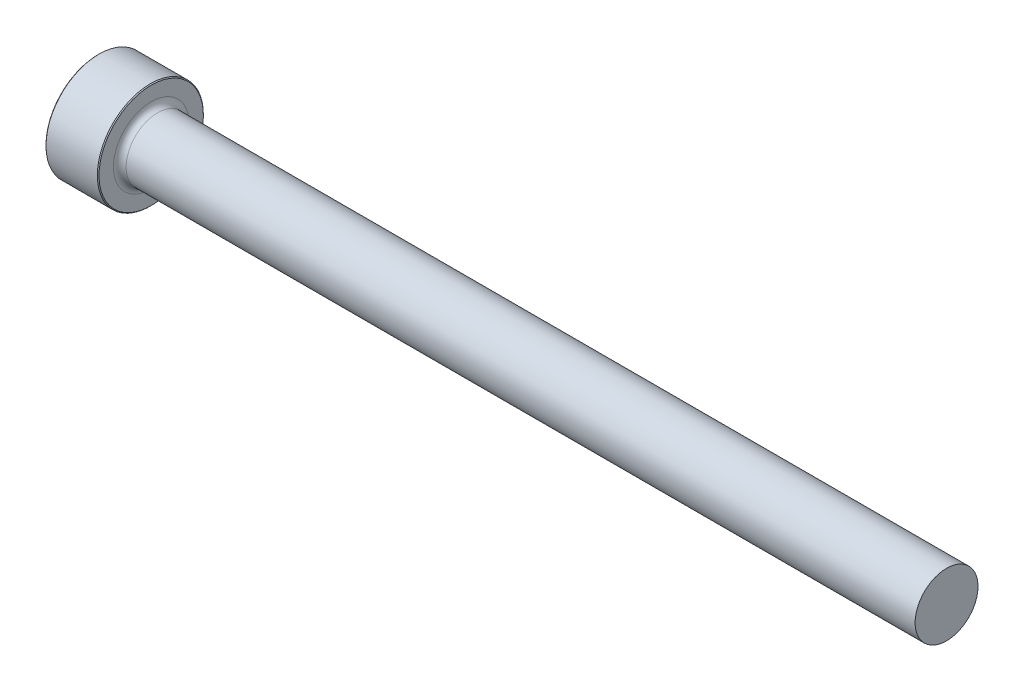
ISO-10303-21;
HEADER;
FILE_DESCRIPTION(('STEP AP214'),'2;1');
FILE_NAME('part.step','',(''),(''),'','','');
FILE_SCHEMA(('AUTOMOTIVE_DESIGN { 1 0 10303 214 1 1 1 1 }'));
ENDSEC;
DATA;
#1=APPLICATION_CONTEXT('core data for automotive mechanical design processes');
#2=APPLICATION_PROTOCOL_DEFINITION('international standard','automotive_design',2000,#1);
#3=PRODUCT_CONTEXT('',#1,'mechanical');
#4=PRODUCT('Part','Part','',(#3));
#5=PRODUCT_RELATED_PRODUCT_CATEGORY('part','',(#4));
#6=PRODUCT_DEFINITION_FORMATION('','',#4);
#7=PRODUCT_DEFINITION_CONTEXT('part definition',#1,'design');
#8=PRODUCT_DEFINITION('design','',#6,#7);
#9=PRODUCT_DEFINITION_SHAPE('','',#8);
#10=(LENGTH_UNIT() NAMED_UNIT(*) SI_UNIT(.MILLI.,.METRE.));
#11=(NAMED_UNIT(*) PLANE_ANGLE_UNIT() SI_UNIT($,.RADIAN.));
#12=(NAMED_UNIT(*) SI_UNIT($,.STERADIAN.) SOLID_ANGLE_UNIT());
#13=UNCERTAINTY_MEASURE_WITH_UNIT(LENGTH_MEASURE(1.E-05),#10,'distance_accuracy_value','');
#14=(GEOMETRIC_REPRESENTATION_CONTEXT(3) GLOBAL_UNCERTAINTY_ASSIGNED_CONTEXT((#13)) GLOBAL_UNIT_ASSIGNED_CONTEXT((#10,
#11,#12)) REPRESENTATION_CONTEXT('',''));
#15=CARTESIAN_POINT('',(0.,0.,0.));
#16=DIRECTION('',(0.,0.,1.));
#17=DIRECTION('',(1.,0.,0.));
#18=AXIS2_PLACEMENT_3D('',#15,#16,#17);
#19=CARTESIAN_POINT('',(101.6,3.76650249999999,0.));
#20=DIRECTION('',(1.,0.,0.));
#21=DIRECTION('',(0.,1.,0.));
#22=AXIS2_PLACEMENT_3D('',#19,#20,#21);
#23=PLANE('',#22);
#24=CARTESIAN_POINT('',(101.6,0.,0.));
#25=DIRECTION('',(1.,0.,0.));
#26=DIRECTION('',(0.,1.,0.));
#27=AXIS2_PLACEMENT_3D('',#24,#25,#26);
#28=CIRCLE('',#27,3.7665025);
#29=CARTESIAN_POINT('',(101.6,3.76650249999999,0.));
#30=VERTEX_POINT('',#29);
#31=EDGE_CURVE('E50',#30,#30,#28,.T.);
#32=ORIENTED_EDGE('',*,*,#31,.T.);
#33=EDGE_LOOP('',(#32));
#34=FACE_BOUND('',#33,.T.);
#35=ADVANCED_FACE('F30',(#34),#23,.T.);
#36=CARTESIAN_POINT('',(101.6,0.,0.));
#37=DIRECTION('',(1.,0.,0.));
#38=DIRECTION('',(0.,1.,0.));
#39=AXIS2_PLACEMENT_3D('',#36,#37,#38);
#40=CYLINDRICAL_SURFACE('',#39,3.7665025);
#41=CARTESIAN_POINT('',(7.11199999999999,0.,0.));
#42=DIRECTION('',(1.,0.,0.));
#43=DIRECTION('',(0.,1.,0.));
#44=AXIS2_PLACEMENT_3D('',#41,#42,#43);
#45=CIRCLE('',#44,3.76650249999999);
#46=CARTESIAN_POINT('',(7.11199999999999,3.76650249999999,0.));
#47=VERTEX_POINT('',#46);
#48=EDGE_CURVE('E53',#47,#47,#45,.T.);
#49=ORIENTED_EDGE('',*,*,#48,.T.);
#50=EDGE_LOOP('',(#49));
#51=FACE_BOUND('',#50,.T.);
#52=ORIENTED_EDGE('',*,*,#31,.F.);
#53=EDGE_LOOP('',(#52));
#54=FACE_BOUND('',#53,.T.);
#55=ADVANCED_FACE('F74',(#51,#54),#40,.T.);
#56=CARTESIAN_POINT('',(7.112,0.,0.));
#57=DIRECTION('',(1.,0.,0.));
#58=DIRECTION('',(0.,1.,0.));
#59=AXIS2_PLACEMENT_3D('',#56,#57,#58);
#60=TOROIDAL_SURFACE('',#59,4.52850249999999,0.762);
#61=CARTESIAN_POINT('',(6.34999999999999,0.,0.));
#62=DIRECTION('',(1.,0.,0.));
#63=DIRECTION('',(0.,1.,0.));
#64=AXIS2_PLACEMENT_3D('',#61,#62,#63);
#65=CIRCLE('',#64,4.52850249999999);
#66=CARTESIAN_POINT('',(6.34999999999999,4.52850249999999,0.));
#67=VERTEX_POINT('',#66);
#68=EDGE_CURVE('E56',#67,#67,#65,.T.);
#69=ORIENTED_EDGE('',*,*,#68,.T.);
#70=EDGE_LOOP('',(#69));
#71=FACE_BOUND('',#70,.T.);
#72=ORIENTED_EDGE('',*,*,#48,.F.);
#73=EDGE_LOOP('',(#72));
#74=FACE_BOUND('',#73,.T.);
#75=ADVANCED_FACE('F60',(#71,#74),#60,.F.);
#76=CARTESIAN_POINT('',(6.35,6.35,0.));
#77=DIRECTION('',(1.,0.,0.));
#78=DIRECTION('',(0.,1.,0.));
#79=AXIS2_PLACEMENT_3D('',#76,#77,#78);
#80=PLANE('',#79);
#81=CARTESIAN_POINT('',(6.35,0.,0.));
#82=DIRECTION('',(1.,0.,0.));
#83=DIRECTION('',(0.,1.,0.));
#84=AXIS2_PLACEMENT_3D('',#81,#82,#83);
#85=CIRCLE('',#84,6.2484);
#86=CARTESIAN_POINT('',(6.35,6.2484,0.));
#87=VERTEX_POINT('',#86);
#88=EDGE_CURVE('E10',#87,#87,#85,.T.);
#89=ORIENTED_EDGE('',*,*,#88,.T.);
#90=EDGE_LOOP('',(#89));
#91=FACE_BOUND('',#90,.T.);
#92=ORIENTED_EDGE('',*,*,#68,.F.);
#93=EDGE_LOOP('',(#92));
#94=FACE_BOUND('',#93,.T.);
#95=ADVANCED_FACE('F63',(#91,#94),#80,.T.);
#96=CARTESIAN_POINT('',(101.6,0.,0.));
#97=DIRECTION('',(1.,0.,0.));
#98=DIRECTION('',(0.,1.,0.));
#99=AXIS2_PLACEMENT_3D('',#96,#97,#98);
#100=CYLINDRICAL_SURFACE('',#99,6.35);
#101=CARTESIAN_POINT('',(0.101599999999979,0.,0.));
#102=DIRECTION('',(-1.,0.,0.));
#103=DIRECTION('',(0.,-1.,0.));
#104=AXIS2_PLACEMENT_3D('',#101,#102,#103);
#105=CIRCLE('',#104,6.35);
#106=CARTESIAN_POINT('',(0.101599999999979,-6.35,0.));
#107=VERTEX_POINT('',#106);
#108=EDGE_CURVE('E41',#107,#107,#105,.F.);
#109=ORIENTED_EDGE('',*,*,#108,.T.);
#110=EDGE_LOOP('',(#109));
#111=FACE_BOUND('',#110,.T.);
#112=CARTESIAN_POINT('',(6.2484,0.,0.));
#113=DIRECTION('',(1.,0.,0.));
#114=DIRECTION('',(0.,1.,0.));
#115=AXIS2_PLACEMENT_3D('',#112,#113,#114);
#116=CIRCLE('',#115,6.35);
#117=CARTESIAN_POINT('',(6.2484,6.35,0.));
#118=VERTEX_POINT('',#117);
#119=EDGE_CURVE('E45',#118,#118,#116,.F.);
#120=ORIENTED_EDGE('',*,*,#119,.T.);
#121=EDGE_LOOP('',(#120));
#122=FACE_BOUND('',#121,.T.);
#123=ADVANCED_FACE('F65',(#111,#122),#100,.T.);
#124=CARTESIAN_POINT('',(0.,0.,0.));
#125=DIRECTION('',(-1.,0.,0.));
#126=DIRECTION('',(0.,-1.,0.));
#127=AXIS2_PLACEMENT_3D('',#124,#125,#126);
#128=PLANE('',#127);
#129=CARTESIAN_POINT('',(0.,0.,0.));
#130=DIRECTION('',(-1.,0.,0.));
#131=DIRECTION('',(0.,-1.,0.));
#132=AXIS2_PLACEMENT_3D('',#129,#130,#131);
#133=CIRCLE('',#132,6.24840000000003);
#134=CARTESIAN_POINT('',(0.,-6.24840000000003,0.));
#135=VERTEX_POINT('',#134);
#136=EDGE_CURVE('E37',#135,#135,#133,.T.);
#137=ORIENTED_EDGE('',*,*,#136,.T.);
#138=EDGE_LOOP('',(#137));
#139=FACE_BOUND('',#138,.T.);
#140=ADVANCED_FACE('F71',(#139),#128,.T.);
#141=CARTESIAN_POINT('',(0.101599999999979,0.,0.));
#142=DIRECTION('',(1.,0.,0.));
#143=DIRECTION('',(0.,1.,0.));
#144=AXIS2_PLACEMENT_3D('',#141,#142,#143);
#145=CONICAL_SURFACE('',#144,6.35,0.78539816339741);
#146=ORIENTED_EDGE('',*,*,#136,.F.);
#147=EDGE_LOOP('',(#146));
#148=FACE_BOUND('',#147,.T.);
#149=ORIENTED_EDGE('',*,*,#108,.F.);
#150=EDGE_LOOP('',(#149));
#151=FACE_BOUND('',#150,.T.);
#152=ADVANCED_FACE('F84',(#148,#151),#145,.T.);
#153=CARTESIAN_POINT('',(6.34999999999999,0.,0.));
#154=DIRECTION('',(-1.,0.,0.));
#155=DIRECTION('',(0.,-1.,0.));
#156=AXIS2_PLACEMENT_3D('',#153,#154,#155);
#157=CONICAL_SURFACE('',#156,6.2484,0.78539816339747);
#158=ORIENTED_EDGE('',*,*,#119,.F.);
#159=EDGE_LOOP('',(#158));
#160=FACE_BOUND('',#159,.T.);
#161=ORIENTED_EDGE('',*,*,#88,.F.);
#162=EDGE_LOOP('',(#161));
#163=FACE_BOUND('',#162,.T.);
#164=ADVANCED_FACE('F32',(#160,#163),#157,.T.);
#165=CLOSED_SHELL('',(#35,#55,#75,#95,#123,#140,#152,#164));
#166=MANIFOLD_SOLID_BREP('B2',#165);
#167=ADVANCED_BREP_SHAPE_REPRESENTATION('',(#18,#166),#14);
#168=SHAPE_DEFINITION_REPRESENTATION(#9,#167);
ENDSEC;
END-ISO-10303-21;
